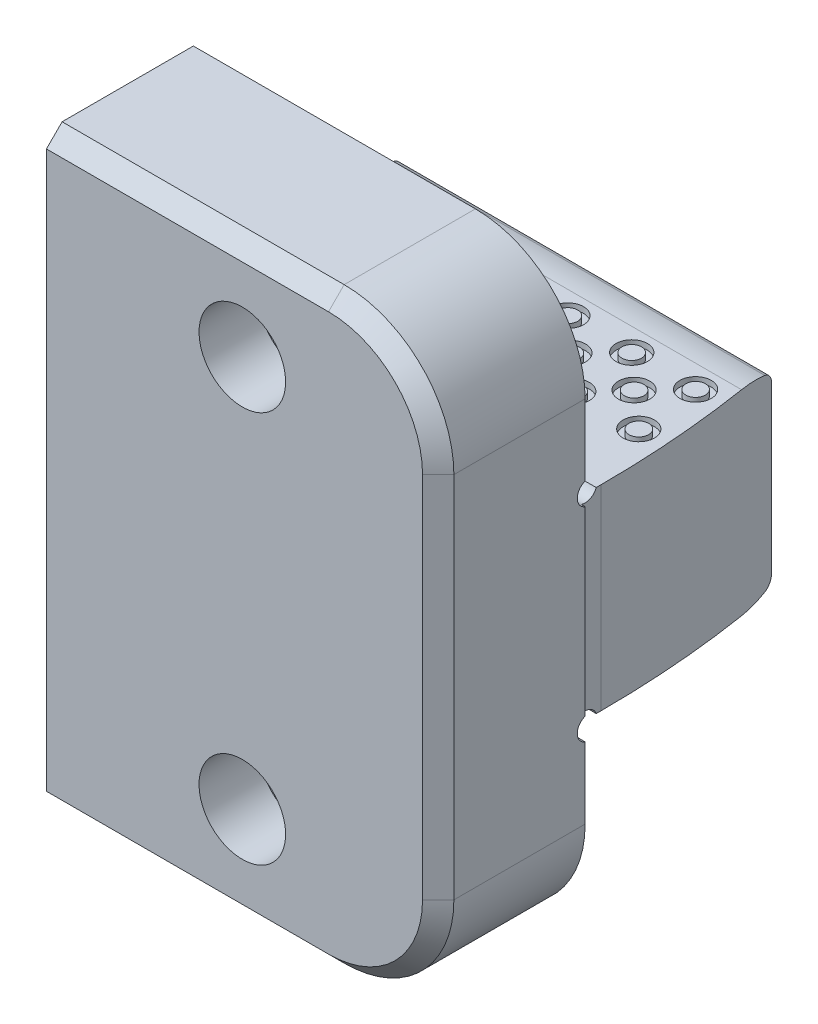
from build123d import *

# Parameters (mm, degrees)
EXTRUDE1_DEPTH         = 12.7
SKETCH7_W              = 21.968267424
SKETCH7_H              = 31.720833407
CUT_EXTRUDE3_DEPTH     = 0.254
SKETCH8_R              = 0.762
CUT_EXTRUDE4_DEPTH     = 35.515871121
CUT_EXTRUDE5_DEPTH     = 35.515871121
CUT_EXTRUDE6_DEPTH     = 43.381397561
SKETCH15_R             = 1.016
SKETCH15_R_2           = 0.635
CUT_EXTRUDE7_DEPTH     = 0.381
F_10_CBORE_D           = 5.6134
F_10_CBORE_CBORE_D     = 9.525
F_10_CBORE_CBORE_DEPTH = 5.61975
FILLET1_R              = 7.112
CHAMFER1_SIZE          = 1.016


with BuildPart() as part:
    # Sketch3 → Extrude1 (new, symmetric)
    with BuildSketch(Plane(origin=(0, 0, 0), x_dir=(0, 0, -1), z_dir=(1, 0, 0))):
        Polygon((-9.525, -19.05), (0, -19.05), (0, -6.34746), (13.5382, -6.34746), (13.5382, 6.34746), (0, 6.34746), (0, 19.05), (-9.525, 19.05), align=None)
    extrude(amount=EXTRUDE1_DEPTH, both=True)

    # Sketch7 → Cut-Extrude3 (cut)
    with BuildSketch(Plane(origin=(12.7, 0, 0), x_dir=(0, 0, -1), z_dir=(1, 0, 0))):
        with Locations((10.984133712, 1.307835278)):
            Rectangle(SKETCH7_W, SKETCH7_H)
    extrude(amount=-CUT_EXTRUDE3_DEPTH, mode=Mode.SUBTRACT)

    # Sketch8 → Cut-Extrude4 (cut, through all)
    with BuildSketch(Plane(origin=(12.7, 0, 0), x_dir=(0, 0, -1), z_dir=(1, 0, 0))):
        with Locations((0.254, 6.60146)):
            Circle(SKETCH8_R)
        with Locations((0.254, -6.60146)):
            Circle(SKETCH8_R)
    extrude(amount=-CUT_EXTRUDE4_DEPTH, mode=Mode.SUBTRACT)

    # Sketch9 → Cut-Extrude5 (cut, through all)
    with BuildSketch(Plane(origin=(12.7, 0, 0), x_dir=(0, 0, -1), z_dir=(1, 0, 0))):
        with BuildLine():
            Line((13.5382, 5.351440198), (17.526, 5.351440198))
            Line((17.526, 5.351440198), (17.526, 11.701440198))
            Line((17.526, 11.701440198), (11.176, 11.701440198))
            Line((11.176, 11.701440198), (11.176, 6.34746))
            ThreePointArc((11.176, 6.34746), (12.09487584, 6.28062538), (12.994409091, 6.081528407))
            ThreePointArc((12.994409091, 6.081528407), (13.387313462, 5.806615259), (13.5382, 5.351440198))
        make_face()
        with BuildLine():
            Line((17.526, -5.351440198), (17.526, -11.701440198))
            Line((17.526, -11.701440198), (11.176, -11.701440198))
            Line((11.176, -11.701440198), (11.176, -6.34746))
            ThreePointArc((11.176, -6.34746), (12.09487584, -6.28062538), (12.994409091, -6.081528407))
            ThreePointArc((12.994409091, -6.081528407), (13.387313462, -5.806615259), (13.5382, -5.351440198))
            Line((13.5382, -5.351440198), (17.526, -5.351440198))
        make_face()
    extrude(amount=-CUT_EXTRUDE5_DEPTH, mode=Mode.SUBTRACT)

    # Sketch13 → Cut-Extrude6 (cut, through all)
    with BuildSketch(Plane(origin=(0, 19.05, 0), x_dir=(1, 0, 0), z_dir=(0, 1, 0))):
        with BuildLine():
            Line((11.163039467, 13.97), (23.863039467, 13.97))
            Line((23.863039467, 13.97), (23.863039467, 1.27))
            Line((23.863039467, 1.27), (12.446, 1.27))
            ThreePointArc((12.446, 1.27), (12.124445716, 7.652319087), (11.163039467, 13.97))
        make_face()
    extrude(amount=-CUT_EXTRUDE6_DEPTH, mode=Mode.SUBTRACT)

    # Sketch15 → Cut-Extrude7 (cut)
    # profile 1 of 17: a face of its own
    with BuildSketch(Plane(origin=(0, 6.34746, 0), x_dir=(1, 0, 0), z_dir=(0, 1, 0))):
        with Locations(Location((-6.4008, 9.7028, 0), (0, 0, 270))):
            Circle(SKETCH15_R)
        with Locations(Location((-6.4008, 9.7028, 0), (0, 0, 270))):
            Circle(SKETCH15_R_2, mode=Mode.SUBTRACT)
    # profile 2 of 17: a face of its own
    with BuildSketch(Plane(origin=(0, 6.34746, 0), x_dir=(1, 0, 0), z_dir=(0, 1, 0))):
        with Locations(Location((-2.2606, 9.7028, 0), (0, 0, 270))):
            Circle(SKETCH15_R)
        with Locations(Location((-2.2606, 9.7028, 0), (0, 0, 270))):
            Circle(SKETCH15_R_2, mode=Mode.SUBTRACT)
    # profile 3 of 17: a face of its own
    with BuildSketch(Plane(origin=(0, 6.34746, 0), x_dir=(1, 0, 0), z_dir=(0, 1, 0))):
        with Locations(Location((-10.541, 9.7028, 0), (0, 0, 270))):
            Circle(SKETCH15_R)
        with Locations(Location((-10.541, 9.7028, 0), (0, 0, 270))):
            Circle(SKETCH15_R_2, mode=Mode.SUBTRACT)
    # profile 4 of 17: a face of its own
    with BuildSketch(Plane(origin=(0, 6.34746, 0), x_dir=(1, 0, 0), z_dir=(0, 1, 0))):
        with Locations(Location((1.8796, 9.7028, 0), (0, 0, 270))):
            Circle(SKETCH15_R)
        with Locations(Location((1.8796, 9.7028, 0), (0, 0, 270))):
            Circle(SKETCH15_R_2, mode=Mode.SUBTRACT)
    # profile 5 of 17: a face of its own
    with BuildSketch(Plane(origin=(0, 6.34746, 0), x_dir=(1, 0, 0), z_dir=(0, 1, 0))):
        with Locations(Location((6.0198, 9.7028, 0), (0, 0, 270))):
            Circle(SKETCH15_R)
        with Locations(Location((6.0198, 9.7028, 0), (0, 0, 270))):
            Circle(SKETCH15_R_2, mode=Mode.SUBTRACT)
    # profile 6 of 17: a face of its own
    with BuildSketch(Plane(origin=(0, 6.34746, 0), x_dir=(1, 0, 0), z_dir=(0, 1, 0))):
        with Locations(Location((10.16, 9.7028, 0), (0, 0, 270))):
            Circle(SKETCH15_R)
        with Locations(Location((10.16, 9.7028, 0), (0, 0, 270))):
            Circle(SKETCH15_R_2, mode=Mode.SUBTRACT)
    # profile 7 of 17: a face of its own
    with BuildSketch(Plane(origin=(0, 6.34746, 0), x_dir=(1, 0, 0), z_dir=(0, 1, 0))):
        with Locations(Location((-4.2926, 7.6708, 0), (0, 0, 270))):
            Circle(SKETCH15_R)
        with Locations(Location((-4.2926, 7.6708, 0), (0, 0, 270))):
            Circle(SKETCH15_R_2, mode=Mode.SUBTRACT)
    # profile 8 of 17: a face of its own
    with BuildSketch(Plane(origin=(0, 6.34746, 0), x_dir=(1, 0, 0), z_dir=(0, 1, 0))):
        with Locations(Location((-0.127, 7.6708, 0), (0, 0, 270))):
            Circle(SKETCH15_R)
        with Locations(Location((-0.127, 7.6708, 0), (0, 0, 270))):
            Circle(SKETCH15_R_2, mode=Mode.SUBTRACT)
    # profile 9 of 17: a face of its own
    with BuildSketch(Plane(origin=(0, 6.34746, 0), x_dir=(1, 0, 0), z_dir=(0, 1, 0))):
        with Locations(Location((-8.4582, 7.6708, 0), (0, 0, 270))):
            Circle(SKETCH15_R)
        with Locations(Location((-8.4582, 7.6708, 0), (0, 0, 270))):
            Circle(SKETCH15_R_2, mode=Mode.SUBTRACT)
    # profile 10 of 17: a face of its own
    with BuildSketch(Plane(origin=(0, 6.34746, 0), x_dir=(1, 0, 0), z_dir=(0, 1, 0))):
        with Locations(Location((4.0386, 7.6708, 0), (0, 0, 270))):
            Circle(SKETCH15_R)
        with Locations(Location((4.0386, 7.6708, 0), (0, 0, 270))):
            Circle(SKETCH15_R_2, mode=Mode.SUBTRACT)
    # profile 11 of 17: a face of its own
    with BuildSketch(Plane(origin=(0, 6.34746, 0), x_dir=(1, 0, 0), z_dir=(0, 1, 0))):
        with Locations(Location((8.2042, 7.6708, 0), (0, 0, 270))):
            Circle(SKETCH15_R)
        with Locations(Location((8.2042, 7.6708, 0), (0, 0, 270))):
            Circle(SKETCH15_R_2, mode=Mode.SUBTRACT)
    # profile 12 of 17: a face of its own
    with BuildSketch(Plane(origin=(0, 6.34746, 0), x_dir=(1, 0, 0), z_dir=(0, 1, 0))):
        with Locations(Location((-6.3246, 5.6388, 0), (0, 0, 270))):
            Circle(SKETCH15_R)
        with Locations(Location((-6.3246, 5.6388, 0), (0, 0, 270))):
            Circle(SKETCH15_R_2, mode=Mode.SUBTRACT)
    # profile 13 of 17: a face of its own
    with BuildSketch(Plane(origin=(0, 6.34746, 0), x_dir=(1, 0, 0), z_dir=(0, 1, 0))):
        with Locations(Location((-2.1082, 5.6388, 0), (0, 0, 270))):
            Circle(SKETCH15_R)
        with Locations(Location((-2.1082, 5.6388, 0), (0, 0, 270))):
            Circle(SKETCH15_R_2, mode=Mode.SUBTRACT)
    # profile 14 of 17: a face of its own
    with BuildSketch(Plane(origin=(0, 6.34746, 0), x_dir=(1, 0, 0), z_dir=(0, 1, 0))):
        with Locations(Location((-10.541, 5.6388, 0), (0, 0, 270))):
            Circle(SKETCH15_R)
        with Locations(Location((-10.541, 5.6388, 0), (0, 0, 270))):
            Circle(SKETCH15_R_2, mode=Mode.SUBTRACT)
    # profile 15 of 17: a face of its own
    with BuildSketch(Plane(origin=(0, 6.34746, 0), x_dir=(1, 0, 0), z_dir=(0, 1, 0))):
        with Locations(Location((2.1082, 5.6388, 0), (0, 0, 270))):
            Circle(SKETCH15_R)
        with Locations(Location((2.1082, 5.6388, 0), (0, 0, 270))):
            Circle(SKETCH15_R_2, mode=Mode.SUBTRACT)
    # profile 16 of 17: a face of its own
    with BuildSketch(Plane(origin=(0, 6.34746, 0), x_dir=(1, 0, 0), z_dir=(0, 1, 0))):
        with Locations(Location((6.3246, 5.6388, 0), (0, 0, 270))):
            Circle(SKETCH15_R)
        with Locations(Location((6.3246, 5.6388, 0), (0, 0, 270))):
            Circle(SKETCH15_R_2, mode=Mode.SUBTRACT)
    # profile 17 of 17: a face of its own
    with BuildSketch(Plane(origin=(0, 6.34746, 0), x_dir=(1, 0, 0), z_dir=(0, 1, 0))):
        with Locations(Location((10.541, 5.6388, 0), (0, 0, 270))):
            Circle(SKETCH15_R)
        with Locations(Location((10.541, 5.6388, 0), (0, 0, 270))):
            Circle(SKETCH15_R_2, mode=Mode.SUBTRACT)
    cut_extrude7 = extrude(amount=-CUT_EXTRUDE7_DEPTH, mode=Mode.SUBTRACT)

    # Mirror1: Cut-Extrude7 across plane
    add(cut_extrude7.mirror(Plane.ZX), mode=Mode.SUBTRACT)

    # 10 CBORE (through all)
    with Locations(Plane(origin=(0, 0, 0), x_dir=(-1, 0, 0), z_dir=(0, 0, -1))):
        with Locations((0, 12.7), (0, -12.7)):
            CounterBoreHole(F_10_CBORE_D / 2, F_10_CBORE_CBORE_D / 2, F_10_CBORE_CBORE_DEPTH)

    # Fillet1
    fillet1_edges = [part.edges().sort_by_distance(p)[0] for p in [
        (12.7, 19.05, 4.7625),
        (12.7, -19.05, 4.7625),
    ]]
    fillet(fillet1_edges, radius=FILLET1_R)

    # Chamfer1
    chamfer1_edges = [part.edges().sort_by_distance(p)[0] for p in [
        (12.7, 0, 9.525),
        (-3.556, -19.05, 9.525),
        (-3.556, 19.05, 9.525),
        (10.616943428, -16.966943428, 9.525),
        (10.616943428, 16.966943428, 9.525),
    ]]
    chamfer(chamfer1_edges, length=CHAMFER1_SIZE)


solid = part.part
